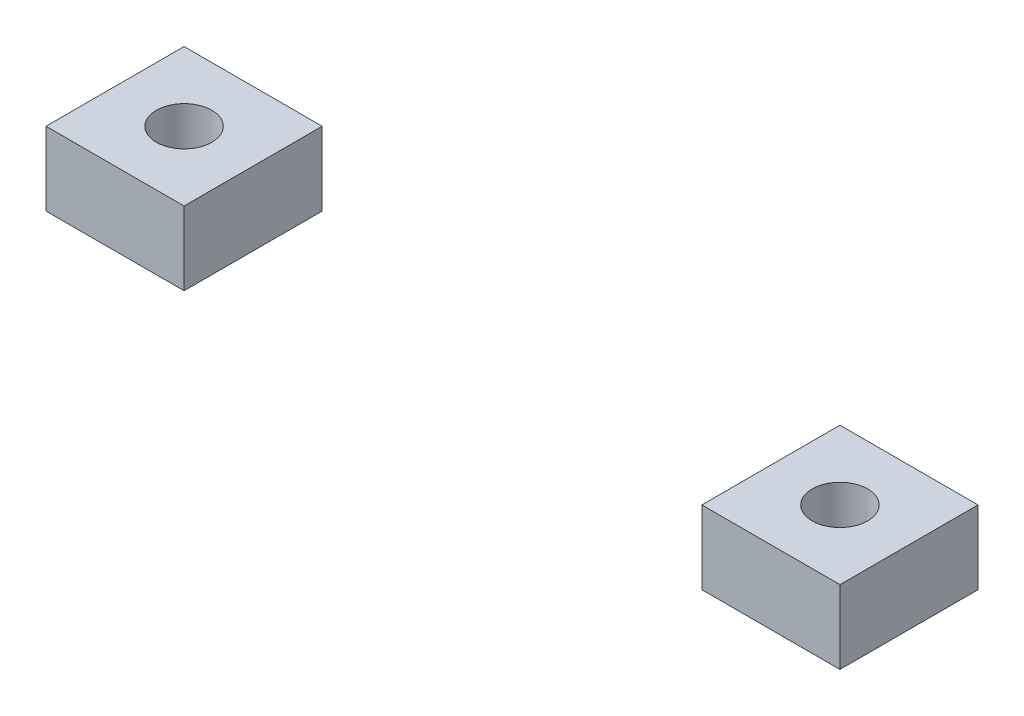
ISO-10303-21;
HEADER;
FILE_DESCRIPTION(('STEP AP214'),'2;1');
FILE_NAME('part.step','',(''),(''),'','','');
FILE_SCHEMA(('AUTOMOTIVE_DESIGN { 1 0 10303 214 1 1 1 1 }'));
ENDSEC;
DATA;
#1=APPLICATION_CONTEXT('core data for automotive mechanical design processes');
#2=APPLICATION_PROTOCOL_DEFINITION('international standard','automotive_design',2000,#1);
#3=PRODUCT_CONTEXT('',#1,'mechanical');
#4=PRODUCT('Part','Part','',(#3));
#5=PRODUCT_RELATED_PRODUCT_CATEGORY('part','',(#4));
#6=PRODUCT_DEFINITION_FORMATION('','',#4);
#7=PRODUCT_DEFINITION_CONTEXT('part definition',#1,'design');
#8=PRODUCT_DEFINITION('design','',#6,#7);
#9=PRODUCT_DEFINITION_SHAPE('','',#8);
#10=(LENGTH_UNIT() NAMED_UNIT(*) SI_UNIT(.MILLI.,.METRE.));
#11=(NAMED_UNIT(*) PLANE_ANGLE_UNIT() SI_UNIT($,.RADIAN.));
#12=(NAMED_UNIT(*) SI_UNIT($,.STERADIAN.) SOLID_ANGLE_UNIT());
#13=UNCERTAINTY_MEASURE_WITH_UNIT(LENGTH_MEASURE(1.E-05),#10,'distance_accuracy_value','');
#14=(GEOMETRIC_REPRESENTATION_CONTEXT(3) GLOBAL_UNCERTAINTY_ASSIGNED_CONTEXT((#13)) GLOBAL_UNIT_ASSIGNED_CONTEXT((#10,
#11,#12)) REPRESENTATION_CONTEXT('',''));
#15=CARTESIAN_POINT('',(0.,0.,0.));
#16=DIRECTION('',(0.,0.,1.));
#17=DIRECTION('',(1.,0.,0.));
#18=AXIS2_PLACEMENT_3D('',#15,#16,#17);
#19=CARTESIAN_POINT('',(0.,6.7564,0.));
#20=DIRECTION('',(0.,1.,0.));
#21=DIRECTION('',(0.,0.,1.));
#22=AXIS2_PLACEMENT_3D('',#19,#20,#21);
#23=PLANE('',#22);
#24=DIRECTION('',(-1.,0.,0.));
#25=VECTOR('',#24,1.);
#26=CARTESIAN_POINT('',(36.5125,6.7564,-6.35));
#27=LINE('',#26,#25);
#28=CARTESIAN_POINT('',(36.5125,6.7564,-6.35));
#29=VERTEX_POINT('',#28);
#30=CARTESIAN_POINT('',(23.8125,6.7564,-6.35));
#31=VERTEX_POINT('',#30);
#32=EDGE_CURVE('E98',#29,#31,#27,.T.);
#33=ORIENTED_EDGE('',*,*,#32,.T.);
#34=DIRECTION('',(0.,0.,1.));
#35=VECTOR('',#34,1.);
#36=CARTESIAN_POINT('',(23.8125,6.7564,-6.35));
#37=LINE('',#36,#35);
#38=CARTESIAN_POINT('',(23.8125,6.7564,6.34999999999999));
#39=VERTEX_POINT('',#38);
#40=EDGE_CURVE('E93',#31,#39,#37,.T.);
#41=ORIENTED_EDGE('',*,*,#40,.T.);
#42=DIRECTION('',(1.,0.,0.));
#43=VECTOR('',#42,1.);
#44=CARTESIAN_POINT('',(23.8125,6.7564,6.34999999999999));
#45=LINE('',#44,#43);
#46=CARTESIAN_POINT('',(36.5125,6.7564,6.34999999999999));
#47=VERTEX_POINT('',#46);
#48=EDGE_CURVE('E96',#39,#47,#45,.T.);
#49=ORIENTED_EDGE('',*,*,#48,.T.);
#50=DIRECTION('',(0.,0.,-1.));
#51=VECTOR('',#50,1.);
#52=CARTESIAN_POINT('',(36.5125,6.7564,6.34999999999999));
#53=LINE('',#52,#51);
#54=EDGE_CURVE('E63',#47,#29,#53,.T.);
#55=ORIENTED_EDGE('',*,*,#54,.T.);
#56=EDGE_LOOP('',(#33,#41,#49,#55));
#57=FACE_BOUND('',#56,.T.);
#58=CARTESIAN_POINT('',(30.1625,6.7564,0.));
#59=DIRECTION('',(0.,1.,0.));
#60=DIRECTION('',(0.,0.,1.));
#61=AXIS2_PLACEMENT_3D('',#58,#59,#60);
#62=CIRCLE('',#61,2.5527);
#63=CARTESIAN_POINT('',(30.1625,6.7564,2.5527));
#64=VERTEX_POINT('',#63);
#65=EDGE_CURVE('E113',#64,#64,#62,.T.);
#66=ORIENTED_EDGE('',*,*,#65,.F.);
#67=EDGE_LOOP('',(#66));
#68=FACE_BOUND('',#67,.T.);
#69=ADVANCED_FACE('F46',(#57,#68),#23,.T.);
#70=CARTESIAN_POINT('',(0.,0.,0.));
#71=DIRECTION('',(0.,1.,0.));
#72=DIRECTION('',(0.,0.,1.));
#73=AXIS2_PLACEMENT_3D('',#70,#71,#72);
#74=PLANE('',#73);
#75=DIRECTION('',(-1.,0.,0.));
#76=VECTOR('',#75,1.);
#77=CARTESIAN_POINT('',(36.5125,0.,-6.35));
#78=LINE('',#77,#76);
#79=CARTESIAN_POINT('',(36.5125,0.,-6.35));
#80=VERTEX_POINT('',#79);
#81=CARTESIAN_POINT('',(23.8125,0.,-6.35));
#82=VERTEX_POINT('',#81);
#83=EDGE_CURVE('E110',#80,#82,#78,.T.);
#84=ORIENTED_EDGE('',*,*,#83,.F.);
#85=DIRECTION('',(0.,0.,-1.));
#86=VECTOR('',#85,1.);
#87=CARTESIAN_POINT('',(36.5125,0.,6.34999999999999));
#88=LINE('',#87,#86);
#89=CARTESIAN_POINT('',(36.5125,0.,6.34999999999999));
#90=VERTEX_POINT('',#89);
#91=EDGE_CURVE('E86',#90,#80,#88,.T.);
#92=ORIENTED_EDGE('',*,*,#91,.F.);
#93=DIRECTION('',(1.,0.,0.));
#94=VECTOR('',#93,1.);
#95=CARTESIAN_POINT('',(23.8125,0.,6.34999999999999));
#96=LINE('',#95,#94);
#97=CARTESIAN_POINT('',(23.8125,0.,6.34999999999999));
#98=VERTEX_POINT('',#97);
#99=EDGE_CURVE('E80',#98,#90,#96,.T.);
#100=ORIENTED_EDGE('',*,*,#99,.F.);
#101=DIRECTION('',(0.,0.,1.));
#102=VECTOR('',#101,1.);
#103=CARTESIAN_POINT('',(23.8125,0.,-6.35));
#104=LINE('',#103,#102);
#105=EDGE_CURVE('E102',#82,#98,#104,.T.);
#106=ORIENTED_EDGE('',*,*,#105,.F.);
#107=EDGE_LOOP('',(#84,#92,#100,#106));
#108=FACE_BOUND('',#107,.T.);
#109=CARTESIAN_POINT('',(30.1625,0.,0.));
#110=DIRECTION('',(0.,1.,0.));
#111=DIRECTION('',(0.,0.,1.));
#112=AXIS2_PLACEMENT_3D('',#109,#110,#111);
#113=CIRCLE('',#112,2.5527);
#114=CARTESIAN_POINT('',(30.1625,0.,2.5527));
#115=VERTEX_POINT('',#114);
#116=EDGE_CURVE('E125',#115,#115,#113,.T.);
#117=ORIENTED_EDGE('',*,*,#116,.T.);
#118=EDGE_LOOP('',(#117));
#119=FACE_BOUND('',#118,.T.);
#120=ADVANCED_FACE('F121',(#108,#119),#74,.F.);
#121=CARTESIAN_POINT('',(36.5125,6.7564,-6.35));
#122=DIRECTION('',(0.,0.,1.));
#123=DIRECTION('',(1.,0.,0.));
#124=AXIS2_PLACEMENT_3D('',#121,#122,#123);
#125=PLANE('',#124);
#126=ORIENTED_EDGE('',*,*,#83,.T.);
#127=DIRECTION('',(0.,-1.,0.));
#128=VECTOR('',#127,1.);
#129=CARTESIAN_POINT('',(23.8125,6.7564,-6.35));
#130=LINE('',#129,#128);
#131=EDGE_CURVE('E12',#31,#82,#130,.T.);
#132=ORIENTED_EDGE('',*,*,#131,.F.);
#133=ORIENTED_EDGE('',*,*,#32,.F.);
#134=DIRECTION('',(0.,-1.,0.));
#135=VECTOR('',#134,1.);
#136=CARTESIAN_POINT('',(36.5125,6.7564,-6.35));
#137=LINE('',#136,#135);
#138=EDGE_CURVE('E106',#29,#80,#137,.T.);
#139=ORIENTED_EDGE('',*,*,#138,.T.);
#140=EDGE_LOOP('',(#126,#132,#133,#139));
#141=FACE_BOUND('',#140,.T.);
#142=ADVANCED_FACE('F48',(#141),#125,.F.);
#143=CARTESIAN_POINT('',(23.8125,6.7564,-6.35));
#144=DIRECTION('',(1.,0.,0.));
#145=DIRECTION('',(0.,0.,-1.));
#146=AXIS2_PLACEMENT_3D('',#143,#144,#145);
#147=PLANE('',#146);
#148=ORIENTED_EDGE('',*,*,#105,.T.);
#149=DIRECTION('',(0.,-1.,0.));
#150=VECTOR('',#149,1.);
#151=CARTESIAN_POINT('',(23.8125,6.7564,6.34999999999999));
#152=LINE('',#151,#150);
#153=EDGE_CURVE('E55',#39,#98,#152,.T.);
#154=ORIENTED_EDGE('',*,*,#153,.F.);
#155=ORIENTED_EDGE('',*,*,#40,.F.);
#156=ORIENTED_EDGE('',*,*,#131,.T.);
#157=EDGE_LOOP('',(#148,#154,#155,#156));
#158=FACE_BOUND('',#157,.T.);
#159=ADVANCED_FACE('F101',(#158),#147,.F.);
#160=CARTESIAN_POINT('',(23.8125,6.7564,6.34999999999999));
#161=DIRECTION('',(0.,0.,-1.));
#162=DIRECTION('',(-1.,0.,0.));
#163=AXIS2_PLACEMENT_3D('',#160,#161,#162);
#164=PLANE('',#163);
#165=ORIENTED_EDGE('',*,*,#99,.T.);
#166=DIRECTION('',(0.,-1.,0.));
#167=VECTOR('',#166,1.);
#168=CARTESIAN_POINT('',(36.5125,6.7564,6.34999999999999));
#169=LINE('',#168,#167);
#170=EDGE_CURVE('E103',#47,#90,#169,.T.);
#171=ORIENTED_EDGE('',*,*,#170,.F.);
#172=ORIENTED_EDGE('',*,*,#48,.F.);
#173=ORIENTED_EDGE('',*,*,#153,.T.);
#174=EDGE_LOOP('',(#165,#171,#172,#173));
#175=FACE_BOUND('',#174,.T.);
#176=ADVANCED_FACE('F104',(#175),#164,.F.);
#177=CARTESIAN_POINT('',(36.5125,6.7564,6.34999999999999));
#178=DIRECTION('',(-1.,0.,0.));
#179=DIRECTION('',(0.,0.,1.));
#180=AXIS2_PLACEMENT_3D('',#177,#178,#179);
#181=PLANE('',#180);
#182=ORIENTED_EDGE('',*,*,#91,.T.);
#183=ORIENTED_EDGE('',*,*,#138,.F.);
#184=ORIENTED_EDGE('',*,*,#54,.F.);
#185=ORIENTED_EDGE('',*,*,#170,.T.);
#186=EDGE_LOOP('',(#182,#183,#184,#185));
#187=FACE_BOUND('',#186,.T.);
#188=ADVANCED_FACE('F118',(#187),#181,.F.);
#189=CARTESIAN_POINT('',(30.1625,6.7564,0.));
#190=DIRECTION('',(0.,-1.,0.));
#191=DIRECTION('',(0.,0.,-1.));
#192=AXIS2_PLACEMENT_3D('',#189,#190,#191);
#193=CYLINDRICAL_SURFACE('',#192,2.5527);
#194=ORIENTED_EDGE('',*,*,#65,.T.);
#195=EDGE_LOOP('',(#194));
#196=FACE_BOUND('',#195,.T.);
#197=ORIENTED_EDGE('',*,*,#116,.F.);
#198=EDGE_LOOP('',(#197));
#199=FACE_BOUND('',#198,.T.);
#200=ADVANCED_FACE('F131',(#196,#199),#193,.F.);
#201=CLOSED_SHELL('',(#69,#120,#142,#159,#176,#188,#200));
#202=MANIFOLD_SOLID_BREP('B2',#201);
#203=CARTESIAN_POINT('',(0.,6.7564,0.));
#204=DIRECTION('',(0.,1.,0.));
#205=DIRECTION('',(0.,0.,1.));
#206=AXIS2_PLACEMENT_3D('',#203,#204,#205);
#207=PLANE('',#206);
#208=DIRECTION('',(-1.,0.,0.));
#209=VECTOR('',#208,1.);
#210=CARTESIAN_POINT('',(-23.8125,6.7564,-6.35));
#211=LINE('',#210,#209);
#212=CARTESIAN_POINT('',(-23.8125,6.7564,-6.35));
#213=VERTEX_POINT('',#212);
#214=CARTESIAN_POINT('',(-36.5125,6.7564,-6.35));
#215=VERTEX_POINT('',#214);
#216=EDGE_CURVE('E256',#213,#215,#211,.T.);
#217=ORIENTED_EDGE('',*,*,#216,.T.);
#218=DIRECTION('',(0.,0.,1.));
#219=VECTOR('',#218,1.);
#220=CARTESIAN_POINT('',(-36.5125,6.7564,-6.35));
#221=LINE('',#220,#219);
#222=CARTESIAN_POINT('',(-36.5125,6.7564,6.34999999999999));
#223=VERTEX_POINT('',#222);
#224=EDGE_CURVE('E251',#215,#223,#221,.T.);
#225=ORIENTED_EDGE('',*,*,#224,.T.);
#226=DIRECTION('',(1.,0.,0.));
#227=VECTOR('',#226,1.);
#228=CARTESIAN_POINT('',(-36.5125,6.7564,6.34999999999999));
#229=LINE('',#228,#227);
#230=CARTESIAN_POINT('',(-23.8125,6.7564,6.34999999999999));
#231=VERTEX_POINT('',#230);
#232=EDGE_CURVE('E254',#223,#231,#229,.T.);
#233=ORIENTED_EDGE('',*,*,#232,.T.);
#234=DIRECTION('',(0.,0.,-1.));
#235=VECTOR('',#234,1.);
#236=CARTESIAN_POINT('',(-23.8125,6.7564,6.34999999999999));
#237=LINE('',#236,#235);
#238=EDGE_CURVE('E221',#231,#213,#237,.T.);
#239=ORIENTED_EDGE('',*,*,#238,.T.);
#240=EDGE_LOOP('',(#217,#225,#233,#239));
#241=FACE_BOUND('',#240,.T.);
#242=CARTESIAN_POINT('',(-30.1625,6.7564,0.));
#243=DIRECTION('',(0.,1.,0.));
#244=DIRECTION('',(0.,0.,1.));
#245=AXIS2_PLACEMENT_3D('',#242,#243,#244);
#246=CIRCLE('',#245,2.5527);
#247=CARTESIAN_POINT('',(-30.1625,6.7564,2.5527));
#248=VERTEX_POINT('',#247);
#249=EDGE_CURVE('E271',#248,#248,#246,.T.);
#250=ORIENTED_EDGE('',*,*,#249,.F.);
#251=EDGE_LOOP('',(#250));
#252=FACE_BOUND('',#251,.T.);
#253=ADVANCED_FACE('F204',(#241,#252),#207,.T.);
#254=CARTESIAN_POINT('',(0.,0.,0.));
#255=DIRECTION('',(0.,1.,0.));
#256=DIRECTION('',(0.,0.,1.));
#257=AXIS2_PLACEMENT_3D('',#254,#255,#256);
#258=PLANE('',#257);
#259=DIRECTION('',(-1.,0.,0.));
#260=VECTOR('',#259,1.);
#261=CARTESIAN_POINT('',(-23.8125,0.,-6.35));
#262=LINE('',#261,#260);
#263=CARTESIAN_POINT('',(-23.8125,0.,-6.35));
#264=VERTEX_POINT('',#263);
#265=CARTESIAN_POINT('',(-36.5125,0.,-6.35));
#266=VERTEX_POINT('',#265);
#267=EDGE_CURVE('E268',#264,#266,#262,.T.);
#268=ORIENTED_EDGE('',*,*,#267,.F.);
#269=DIRECTION('',(0.,0.,-1.));
#270=VECTOR('',#269,1.);
#271=CARTESIAN_POINT('',(-23.8125,0.,6.34999999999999));
#272=LINE('',#271,#270);
#273=CARTESIAN_POINT('',(-23.8125,0.,6.34999999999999));
#274=VERTEX_POINT('',#273);
#275=EDGE_CURVE('E244',#274,#264,#272,.T.);
#276=ORIENTED_EDGE('',*,*,#275,.F.);
#277=DIRECTION('',(1.,0.,0.));
#278=VECTOR('',#277,1.);
#279=CARTESIAN_POINT('',(-36.5125,0.,6.34999999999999));
#280=LINE('',#279,#278);
#281=CARTESIAN_POINT('',(-36.5125,0.,6.34999999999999));
#282=VERTEX_POINT('',#281);
#283=EDGE_CURVE('E238',#282,#274,#280,.T.);
#284=ORIENTED_EDGE('',*,*,#283,.F.);
#285=DIRECTION('',(0.,0.,1.));
#286=VECTOR('',#285,1.);
#287=CARTESIAN_POINT('',(-36.5125,0.,-6.35));
#288=LINE('',#287,#286);
#289=EDGE_CURVE('E260',#266,#282,#288,.T.);
#290=ORIENTED_EDGE('',*,*,#289,.F.);
#291=EDGE_LOOP('',(#268,#276,#284,#290));
#292=FACE_BOUND('',#291,.T.);
#293=CARTESIAN_POINT('',(-30.1625,0.,0.));
#294=DIRECTION('',(0.,1.,0.));
#295=DIRECTION('',(0.,0.,1.));
#296=AXIS2_PLACEMENT_3D('',#293,#294,#295);
#297=CIRCLE('',#296,2.5527);
#298=CARTESIAN_POINT('',(-30.1625,0.,2.5527));
#299=VERTEX_POINT('',#298);
#300=EDGE_CURVE('E283',#299,#299,#297,.T.);
#301=ORIENTED_EDGE('',*,*,#300,.T.);
#302=EDGE_LOOP('',(#301));
#303=FACE_BOUND('',#302,.T.);
#304=ADVANCED_FACE('F279',(#292,#303),#258,.F.);
#305=CARTESIAN_POINT('',(-23.8125,6.7564,-6.35));
#306=DIRECTION('',(0.,0.,1.));
#307=DIRECTION('',(1.,0.,0.));
#308=AXIS2_PLACEMENT_3D('',#305,#306,#307);
#309=PLANE('',#308);
#310=ORIENTED_EDGE('',*,*,#267,.T.);
#311=DIRECTION('',(0.,-1.,0.));
#312=VECTOR('',#311,1.);
#313=CARTESIAN_POINT('',(-36.5125,6.7564,-6.35));
#314=LINE('',#313,#312);
#315=EDGE_CURVE('E44',#215,#266,#314,.T.);
#316=ORIENTED_EDGE('',*,*,#315,.F.);
#317=ORIENTED_EDGE('',*,*,#216,.F.);
#318=DIRECTION('',(0.,-1.,0.));
#319=VECTOR('',#318,1.);
#320=CARTESIAN_POINT('',(-23.8125,6.7564,-6.35));
#321=LINE('',#320,#319);
#322=EDGE_CURVE('E264',#213,#264,#321,.T.);
#323=ORIENTED_EDGE('',*,*,#322,.T.);
#324=EDGE_LOOP('',(#310,#316,#317,#323));
#325=FACE_BOUND('',#324,.T.);
#326=ADVANCED_FACE('F206',(#325),#309,.F.);
#327=CARTESIAN_POINT('',(-36.5125,6.7564,-6.35));
#328=DIRECTION('',(1.,0.,0.));
#329=DIRECTION('',(0.,0.,-1.));
#330=AXIS2_PLACEMENT_3D('',#327,#328,#329);
#331=PLANE('',#330);
#332=ORIENTED_EDGE('',*,*,#289,.T.);
#333=DIRECTION('',(0.,-1.,0.));
#334=VECTOR('',#333,1.);
#335=CARTESIAN_POINT('',(-36.5125,6.7564,6.34999999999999));
#336=LINE('',#335,#334);
#337=EDGE_CURVE('E213',#223,#282,#336,.T.);
#338=ORIENTED_EDGE('',*,*,#337,.F.);
#339=ORIENTED_EDGE('',*,*,#224,.F.);
#340=ORIENTED_EDGE('',*,*,#315,.T.);
#341=EDGE_LOOP('',(#332,#338,#339,#340));
#342=FACE_BOUND('',#341,.T.);
#343=ADVANCED_FACE('F259',(#342),#331,.F.);
#344=CARTESIAN_POINT('',(-36.5125,6.7564,6.34999999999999));
#345=DIRECTION('',(0.,0.,-1.));
#346=DIRECTION('',(-1.,0.,0.));
#347=AXIS2_PLACEMENT_3D('',#344,#345,#346);
#348=PLANE('',#347);
#349=ORIENTED_EDGE('',*,*,#283,.T.);
#350=DIRECTION('',(0.,-1.,0.));
#351=VECTOR('',#350,1.);
#352=CARTESIAN_POINT('',(-23.8125,6.7564,6.34999999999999));
#353=LINE('',#352,#351);
#354=EDGE_CURVE('E261',#231,#274,#353,.T.);
#355=ORIENTED_EDGE('',*,*,#354,.F.);
#356=ORIENTED_EDGE('',*,*,#232,.F.);
#357=ORIENTED_EDGE('',*,*,#337,.T.);
#358=EDGE_LOOP('',(#349,#355,#356,#357));
#359=FACE_BOUND('',#358,.T.);
#360=ADVANCED_FACE('F262',(#359),#348,.F.);
#361=CARTESIAN_POINT('',(-23.8125,6.7564,6.34999999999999));
#362=DIRECTION('',(-1.,0.,0.));
#363=DIRECTION('',(0.,0.,1.));
#364=AXIS2_PLACEMENT_3D('',#361,#362,#363);
#365=PLANE('',#364);
#366=ORIENTED_EDGE('',*,*,#275,.T.);
#367=ORIENTED_EDGE('',*,*,#322,.F.);
#368=ORIENTED_EDGE('',*,*,#238,.F.);
#369=ORIENTED_EDGE('',*,*,#354,.T.);
#370=EDGE_LOOP('',(#366,#367,#368,#369));
#371=FACE_BOUND('',#370,.T.);
#372=ADVANCED_FACE('F276',(#371),#365,.F.);
#373=CARTESIAN_POINT('',(-30.1625,6.7564,0.));
#374=DIRECTION('',(0.,-1.,0.));
#375=DIRECTION('',(0.,0.,-1.));
#376=AXIS2_PLACEMENT_3D('',#373,#374,#375);
#377=CYLINDRICAL_SURFACE('',#376,2.5527);
#378=ORIENTED_EDGE('',*,*,#249,.T.);
#379=EDGE_LOOP('',(#378));
#380=FACE_BOUND('',#379,.T.);
#381=ORIENTED_EDGE('',*,*,#300,.F.);
#382=EDGE_LOOP('',(#381));
#383=FACE_BOUND('',#382,.T.);
#384=ADVANCED_FACE('F289',(#380,#383),#377,.F.);
#385=CLOSED_SHELL('',(#253,#304,#326,#343,#360,#372,#384));
#386=MANIFOLD_SOLID_BREP('B6',#385);
#387=ADVANCED_BREP_SHAPE_REPRESENTATION('',(#18,#202,#386),#14);
#388=SHAPE_DEFINITION_REPRESENTATION(#9,#387);
ENDSEC;
END-ISO-10303-21;
